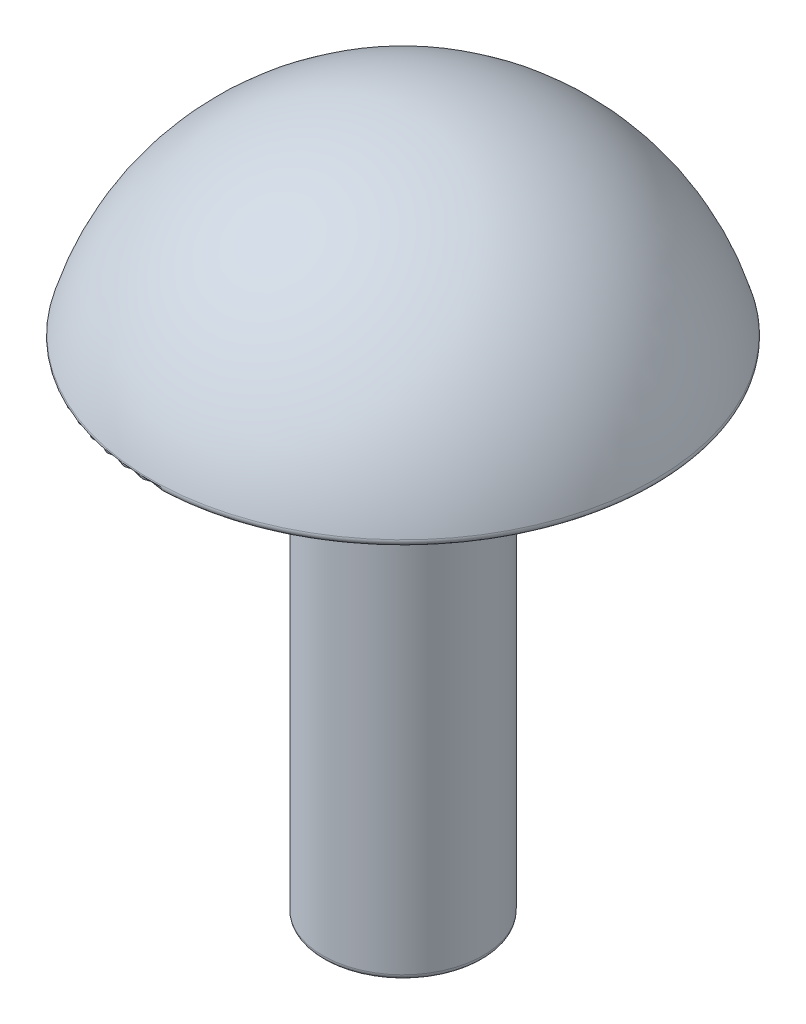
from build123d import *

# Parameters (mm, degrees)
FILLET2_R = 0.1


with BuildPart() as part:
    # Sketch1 → Revolve1 (revolve)
    with BuildSketch(Plane.XY):
        with BuildLine():
            Line((0, 3.560597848), (0, -9.439402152))
            Line((0, -9.439402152), (1.5, -9.439402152))
            Line((1.5, -9.439402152), (1.5, -0.139402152))
            Line((1.5, -0.139402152), (4.75, -0.139402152))
            ThreePointArc((4.75, -0.139402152), (3.01050245, 2.526445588), (0, 3.560597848))
        make_face()
    revolve(axis=Axis((0, 3.560597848, 0), (0, -1, 0)))

    # Fillet2
    fillet2_edges = [part.edges().sort_by_distance(p)[0] for p in [
        (-1.5, -9.439402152, 0),
        (-1.5, -0.139402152, 0),
        (-4.75, -0.139402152, 0),
    ]]
    fillet(fillet2_edges, radius=FILLET2_R)


solid = part.part
